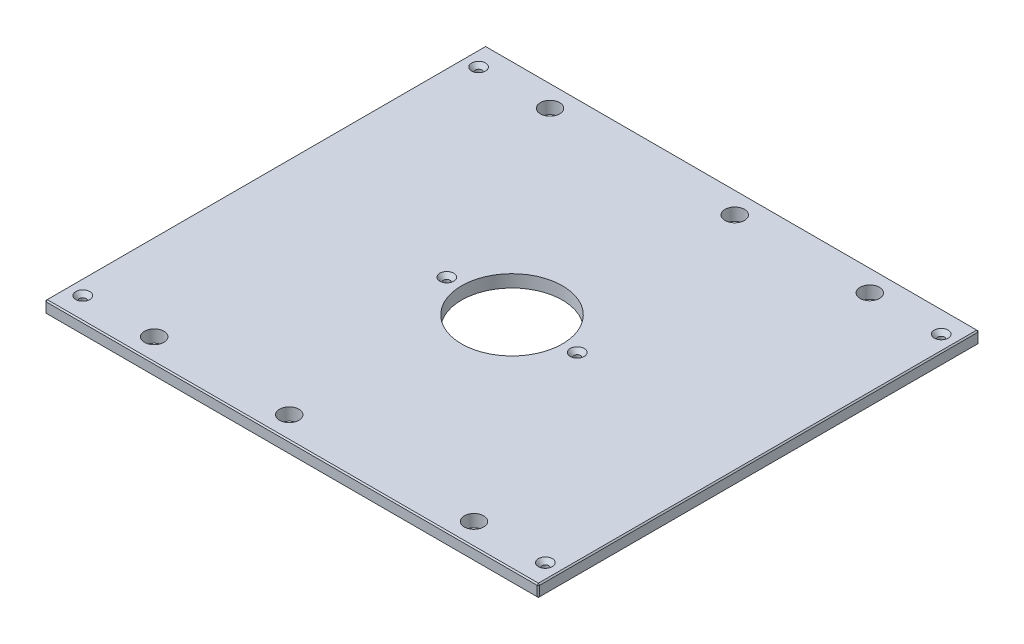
ISO-10303-21;
HEADER;
FILE_DESCRIPTION(('STEP AP214'),'2;1');
FILE_NAME('part.step','',(''),(''),'','','');
FILE_SCHEMA(('AUTOMOTIVE_DESIGN { 1 0 10303 214 1 1 1 1 }'));
ENDSEC;
DATA;
#1=APPLICATION_CONTEXT('core data for automotive mechanical design processes');
#2=APPLICATION_PROTOCOL_DEFINITION('international standard','automotive_design',2000,#1);
#3=PRODUCT_CONTEXT('',#1,'mechanical');
#4=PRODUCT('Part','Part','',(#3));
#5=PRODUCT_RELATED_PRODUCT_CATEGORY('part','',(#4));
#6=PRODUCT_DEFINITION_FORMATION('','',#4);
#7=PRODUCT_DEFINITION_CONTEXT('part definition',#1,'design');
#8=PRODUCT_DEFINITION('design','',#6,#7);
#9=PRODUCT_DEFINITION_SHAPE('','',#8);
#10=(LENGTH_UNIT() NAMED_UNIT(*) SI_UNIT(.MILLI.,.METRE.));
#11=(NAMED_UNIT(*) PLANE_ANGLE_UNIT() SI_UNIT($,.RADIAN.));
#12=(NAMED_UNIT(*) SI_UNIT($,.STERADIAN.) SOLID_ANGLE_UNIT());
#13=UNCERTAINTY_MEASURE_WITH_UNIT(LENGTH_MEASURE(1.E-05),#10,'distance_accuracy_value','');
#14=(GEOMETRIC_REPRESENTATION_CONTEXT(3) GLOBAL_UNCERTAINTY_ASSIGNED_CONTEXT((#13)) GLOBAL_UNIT_ASSIGNED_CONTEXT((#10,
#11,#12)) REPRESENTATION_CONTEXT('',''));
#15=CARTESIAN_POINT('',(0.,0.,0.));
#16=DIRECTION('',(0.,0.,1.));
#17=DIRECTION('',(1.,0.,0.));
#18=AXIS2_PLACEMENT_3D('',#15,#16,#17);
#19=CARTESIAN_POINT('',(-252.4125,12.7,-225.425));
#20=DIRECTION('',(1.,0.,0.));
#21=DIRECTION('',(0.,0.,-1.));
#22=AXIS2_PLACEMENT_3D('',#19,#20,#21);
#23=PLANE('',#22);
#24=DIRECTION('',(0.,0.,-1.));
#25=VECTOR('',#24,1.);
#26=CARTESIAN_POINT('',(-252.4125,11.43,-225.425));
#27=LINE('',#26,#25);
#28=CARTESIAN_POINT('',(-252.4125,11.43,224.155));
#29=VERTEX_POINT('',#28);
#30=CARTESIAN_POINT('',(-252.4125,11.43,-224.155));
#31=VERTEX_POINT('',#30);
#32=EDGE_CURVE('E135',#29,#31,#27,.T.);
#33=ORIENTED_EDGE('',*,*,#32,.T.);
#34=DIRECTION('',(0.,-1.,0.));
#35=VECTOR('',#34,1.);
#36=CARTESIAN_POINT('',(-252.4125,12.7,-224.155));
#37=LINE('',#36,#35);
#38=CARTESIAN_POINT('',(-252.4125,1.26999999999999,-224.155));
#39=VERTEX_POINT('',#38);
#40=EDGE_CURVE('E131',#31,#39,#37,.T.);
#41=ORIENTED_EDGE('',*,*,#40,.T.);
#42=DIRECTION('',(0.,0.,1.));
#43=VECTOR('',#42,1.);
#44=CARTESIAN_POINT('',(-252.4125,1.26999999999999,-225.425));
#45=LINE('',#44,#43);
#46=CARTESIAN_POINT('',(-252.4125,1.26999999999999,224.155));
#47=VERTEX_POINT('',#46);
#48=EDGE_CURVE('E126',#39,#47,#45,.T.);
#49=ORIENTED_EDGE('',*,*,#48,.T.);
#50=DIRECTION('',(0.,1.,0.));
#51=VECTOR('',#50,1.);
#52=CARTESIAN_POINT('',(-252.4125,12.7,224.155));
#53=LINE('',#52,#51);
#54=EDGE_CURVE('E128',#47,#29,#53,.T.);
#55=ORIENTED_EDGE('',*,*,#54,.T.);
#56=EDGE_LOOP('',(#33,#41,#49,#55));
#57=FACE_BOUND('',#56,.T.);
#58=ADVANCED_FACE('F35',(#57),#23,.F.);
#59=CARTESIAN_POINT('',(-252.4125,12.7,225.425));
#60=DIRECTION('',(0.,0.,-1.));
#61=DIRECTION('',(-1.,0.,0.));
#62=AXIS2_PLACEMENT_3D('',#59,#60,#61);
#63=PLANE('',#62);
#64=DIRECTION('',(1.,0.,0.));
#65=VECTOR('',#64,1.);
#66=CARTESIAN_POINT('',(-252.4125,1.26999999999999,225.425));
#67=LINE('',#66,#65);
#68=CARTESIAN_POINT('',(-251.1425,1.26999999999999,225.425));
#69=VERTEX_POINT('',#68);
#70=CARTESIAN_POINT('',(251.1425,1.26999999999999,225.425));
#71=VERTEX_POINT('',#70);
#72=EDGE_CURVE('E58',#69,#71,#67,.T.);
#73=ORIENTED_EDGE('',*,*,#72,.T.);
#74=DIRECTION('',(0.,1.,0.));
#75=VECTOR('',#74,1.);
#76=CARTESIAN_POINT('',(251.1425,12.7,225.425));
#77=LINE('',#76,#75);
#78=CARTESIAN_POINT('',(251.1425,11.43,225.425));
#79=VERTEX_POINT('',#78);
#80=EDGE_CURVE('E11',#71,#79,#77,.T.);
#81=ORIENTED_EDGE('',*,*,#80,.T.);
#82=DIRECTION('',(-1.,0.,0.));
#83=VECTOR('',#82,1.);
#84=CARTESIAN_POINT('',(-252.4125,11.43,225.425));
#85=LINE('',#84,#83);
#86=CARTESIAN_POINT('',(-251.1425,11.43,225.425));
#87=VERTEX_POINT('',#86);
#88=EDGE_CURVE('E44',#79,#87,#85,.T.);
#89=ORIENTED_EDGE('',*,*,#88,.T.);
#90=DIRECTION('',(0.,-1.,0.));
#91=VECTOR('',#90,1.);
#92=CARTESIAN_POINT('',(-251.1425,12.7,225.425));
#93=LINE('',#92,#91);
#94=EDGE_CURVE('E291',#87,#69,#93,.T.);
#95=ORIENTED_EDGE('',*,*,#94,.T.);
#96=EDGE_LOOP('',(#73,#81,#89,#95));
#97=FACE_BOUND('',#96,.T.);
#98=ADVANCED_FACE('F360',(#97),#63,.F.);
#99=CARTESIAN_POINT('',(252.4125,12.7,-225.425));
#100=DIRECTION('',(-1.,0.,0.));
#101=DIRECTION('',(0.,0.,1.));
#102=AXIS2_PLACEMENT_3D('',#99,#100,#101);
#103=PLANE('',#102);
#104=DIRECTION('',(0.,0.,-1.));
#105=VECTOR('',#104,1.);
#106=CARTESIAN_POINT('',(252.4125,1.26999999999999,-225.425));
#107=LINE('',#106,#105);
#108=CARTESIAN_POINT('',(252.4125,1.26999999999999,224.155));
#109=VERTEX_POINT('',#108);
#110=CARTESIAN_POINT('',(252.4125,1.26999999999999,-224.155));
#111=VERTEX_POINT('',#110);
#112=EDGE_CURVE('E286',#109,#111,#107,.T.);
#113=ORIENTED_EDGE('',*,*,#112,.T.);
#114=DIRECTION('',(0.,1.,0.));
#115=VECTOR('',#114,1.);
#116=CARTESIAN_POINT('',(252.4125,12.7,-224.155));
#117=LINE('',#116,#115);
#118=CARTESIAN_POINT('',(252.4125,11.43,-224.155));
#119=VERTEX_POINT('',#118);
#120=EDGE_CURVE('E288',#111,#119,#117,.T.);
#121=ORIENTED_EDGE('',*,*,#120,.T.);
#122=DIRECTION('',(0.,0.,1.));
#123=VECTOR('',#122,1.);
#124=CARTESIAN_POINT('',(252.4125,11.43,225.425));
#125=LINE('',#124,#123);
#126=CARTESIAN_POINT('',(252.4125,11.43,224.155));
#127=VERTEX_POINT('',#126);
#128=EDGE_CURVE('E284',#119,#127,#125,.T.);
#129=ORIENTED_EDGE('',*,*,#128,.T.);
#130=DIRECTION('',(0.,-1.,0.));
#131=VECTOR('',#130,1.);
#132=CARTESIAN_POINT('',(252.4125,12.7,224.155));
#133=LINE('',#132,#131);
#134=EDGE_CURVE('E282',#127,#109,#133,.T.);
#135=ORIENTED_EDGE('',*,*,#134,.T.);
#136=EDGE_LOOP('',(#113,#121,#129,#135));
#137=FACE_BOUND('',#136,.T.);
#138=ADVANCED_FACE('F347',(#137),#103,.F.);
#139=CARTESIAN_POINT('',(-252.4125,12.7,-225.425));
#140=DIRECTION('',(0.,0.,1.));
#141=DIRECTION('',(1.,0.,0.));
#142=AXIS2_PLACEMENT_3D('',#139,#140,#141);
#143=PLANE('',#142);
#144=DIRECTION('',(-1.,0.,0.));
#145=VECTOR('',#144,1.);
#146=CARTESIAN_POINT('',(-252.4125,1.26999999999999,-225.425));
#147=LINE('',#146,#145);
#148=CARTESIAN_POINT('',(251.1425,1.26999999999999,-225.425));
#149=VERTEX_POINT('',#148);
#150=CARTESIAN_POINT('',(-251.1425,1.26999999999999,-225.425));
#151=VERTEX_POINT('',#150);
#152=EDGE_CURVE('E258',#149,#151,#147,.T.);
#153=ORIENTED_EDGE('',*,*,#152,.T.);
#154=DIRECTION('',(0.,1.,0.));
#155=VECTOR('',#154,1.);
#156=CARTESIAN_POINT('',(-251.1425,12.7,-225.425));
#157=LINE('',#156,#155);
#158=CARTESIAN_POINT('',(-251.1425,11.43,-225.425));
#159=VERTEX_POINT('',#158);
#160=EDGE_CURVE('E262',#151,#159,#157,.T.);
#161=ORIENTED_EDGE('',*,*,#160,.T.);
#162=DIRECTION('',(1.,0.,0.));
#163=VECTOR('',#162,1.);
#164=CARTESIAN_POINT('',(252.4125,11.43,-225.425));
#165=LINE('',#164,#163);
#166=CARTESIAN_POINT('',(251.1425,11.43,-225.425));
#167=VERTEX_POINT('',#166);
#168=EDGE_CURVE('E260',#159,#167,#165,.T.);
#169=ORIENTED_EDGE('',*,*,#168,.T.);
#170=DIRECTION('',(0.,-1.,0.));
#171=VECTOR('',#170,1.);
#172=CARTESIAN_POINT('',(251.1425,12.7,-225.425));
#173=LINE('',#172,#171);
#174=EDGE_CURVE('E256',#167,#149,#173,.T.);
#175=ORIENTED_EDGE('',*,*,#174,.T.);
#176=EDGE_LOOP('',(#153,#161,#169,#175));
#177=FACE_BOUND('',#176,.T.);
#178=ADVANCED_FACE('F321',(#177),#143,.F.);
#179=CARTESIAN_POINT('',(0.,12.7,0.));
#180=DIRECTION('',(0.,1.,0.));
#181=DIRECTION('',(0.,0.,1.));
#182=AXIS2_PLACEMENT_3D('',#179,#180,#181);
#183=PLANE('',#182);
#184=CARTESIAN_POINT('',(236.5375,12.7,-202.40498));
#185=DIRECTION('',(0.,1.,0.));
#186=DIRECTION('',(0.,0.,1.));
#187=AXIS2_PLACEMENT_3D('',#184,#185,#186);
#188=CIRCLE('',#187,7.13739999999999);
#189=CARTESIAN_POINT('',(236.5375,12.7,-195.26758));
#190=VERTEX_POINT('',#189);
#191=EDGE_CURVE('E784',#190,#190,#188,.T.);
#192=ORIENTED_EDGE('',*,*,#191,.F.);
#193=EDGE_LOOP('',(#192));
#194=FACE_BOUND('',#193,.T.);
#195=CARTESIAN_POINT('',(236.5375,12.7,202.40498));
#196=DIRECTION('',(0.,1.,0.));
#197=DIRECTION('',(0.,0.,1.));
#198=AXIS2_PLACEMENT_3D('',#195,#196,#197);
#199=CIRCLE('',#198,7.13739999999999);
#200=CARTESIAN_POINT('',(236.5375,12.7,209.54238));
#201=VERTEX_POINT('',#200);
#202=EDGE_CURVE('E788',#201,#201,#199,.T.);
#203=ORIENTED_EDGE('',*,*,#202,.F.);
#204=EDGE_LOOP('',(#203));
#205=FACE_BOUND('',#204,.T.);
#206=CARTESIAN_POINT('',(-236.5375,12.7,202.40498));
#207=DIRECTION('',(0.,1.,0.));
#208=DIRECTION('',(0.,0.,1.));
#209=AXIS2_PLACEMENT_3D('',#206,#207,#208);
#210=CIRCLE('',#209,7.13739999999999);
#211=CARTESIAN_POINT('',(-236.5375,12.7,209.54238));
#212=VERTEX_POINT('',#211);
#213=EDGE_CURVE('E792',#212,#212,#210,.T.);
#214=ORIENTED_EDGE('',*,*,#213,.F.);
#215=EDGE_LOOP('',(#214));
#216=FACE_BOUND('',#215,.T.);
#217=CARTESIAN_POINT('',(-66.675,12.7,0.));
#218=DIRECTION('',(0.,1.,0.));
#219=DIRECTION('',(0.,0.,1.));
#220=AXIS2_PLACEMENT_3D('',#217,#218,#219);
#221=CIRCLE('',#220,7.1374);
#222=CARTESIAN_POINT('',(-66.675,12.7,7.1374));
#223=VERTEX_POINT('',#222);
#224=EDGE_CURVE('E796',#223,#223,#221,.T.);
#225=ORIENTED_EDGE('',*,*,#224,.F.);
#226=EDGE_LOOP('',(#225));
#227=FACE_BOUND('',#226,.T.);
#228=CARTESIAN_POINT('',(66.675,12.7,0.));
#229=DIRECTION('',(0.,1.,0.));
#230=DIRECTION('',(0.,0.,1.));
#231=AXIS2_PLACEMENT_3D('',#228,#229,#230);
#232=CIRCLE('',#231,7.1374);
#233=CARTESIAN_POINT('',(66.675,12.7,7.1374));
#234=VERTEX_POINT('',#233);
#235=EDGE_CURVE('E800',#234,#234,#232,.T.);
#236=ORIENTED_EDGE('',*,*,#235,.F.);
#237=EDGE_LOOP('',(#236));
#238=FACE_BOUND('',#237,.T.);
#239=CARTESIAN_POINT('',(-236.5375,12.7,-202.40498));
#240=DIRECTION('',(0.,1.,0.));
#241=DIRECTION('',(0.,0.,1.));
#242=AXIS2_PLACEMENT_3D('',#239,#240,#241);
#243=CIRCLE('',#242,7.13739999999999);
#244=CARTESIAN_POINT('',(-236.5375,12.7,-195.26758));
#245=VERTEX_POINT('',#244);
#246=EDGE_CURVE('E803',#245,#245,#243,.T.);
#247=ORIENTED_EDGE('',*,*,#246,.F.);
#248=EDGE_LOOP('',(#247));
#249=FACE_BOUND('',#248,.T.);
#250=DIRECTION('',(0.,0.,-1.));
#251=VECTOR('',#250,1.);
#252=CARTESIAN_POINT('',(251.1425,12.7,-225.425));
#253=LINE('',#252,#251);
#254=CARTESIAN_POINT('',(251.1425,12.7,224.155));
#255=VERTEX_POINT('',#254);
#256=CARTESIAN_POINT('',(251.1425,12.7,-224.155));
#257=VERTEX_POINT('',#256);
#258=EDGE_CURVE('E269',#255,#257,#253,.T.);
#259=ORIENTED_EDGE('',*,*,#258,.T.);
#260=DIRECTION('',(-1.,0.,0.));
#261=VECTOR('',#260,1.);
#262=CARTESIAN_POINT('',(-252.4125,12.7,-224.155));
#263=LINE('',#262,#261);
#264=CARTESIAN_POINT('',(-251.1425,12.7,-224.155));
#265=VERTEX_POINT('',#264);
#266=EDGE_CURVE('E271',#257,#265,#263,.T.);
#267=ORIENTED_EDGE('',*,*,#266,.T.);
#268=DIRECTION('',(0.,0.,1.));
#269=VECTOR('',#268,1.);
#270=CARTESIAN_POINT('',(-251.1425,12.7,225.425));
#271=LINE('',#270,#269);
#272=CARTESIAN_POINT('',(-251.1425,12.7,224.155));
#273=VERTEX_POINT('',#272);
#274=EDGE_CURVE('E267',#265,#273,#271,.T.);
#275=ORIENTED_EDGE('',*,*,#274,.T.);
#276=DIRECTION('',(1.,0.,0.));
#277=VECTOR('',#276,1.);
#278=CARTESIAN_POINT('',(252.4125,12.7,224.155));
#279=LINE('',#278,#277);
#280=EDGE_CURVE('E265',#273,#255,#279,.T.);
#281=ORIENTED_EDGE('',*,*,#280,.T.);
#282=EDGE_LOOP('',(#259,#267,#275,#281));
#283=FACE_BOUND('',#282,.T.);
#284=CARTESIAN_POINT('',(163.5125,12.7,-202.40498));
#285=DIRECTION('',(0.,1.,0.));
#286=DIRECTION('',(0.,0.,1.));
#287=AXIS2_PLACEMENT_3D('',#284,#285,#286);
#288=CIRCLE('',#287,9.921875);
#289=CARTESIAN_POINT('',(163.5125,12.7,-192.483105));
#290=VERTEX_POINT('',#289);
#291=EDGE_CURVE('E204',#290,#290,#288,.T.);
#292=ORIENTED_EDGE('',*,*,#291,.F.);
#293=EDGE_LOOP('',(#292));
#294=FACE_BOUND('',#293,.T.);
#295=CARTESIAN_POINT('',(-163.5125,12.7,-202.40498));
#296=DIRECTION('',(0.,1.,0.));
#297=DIRECTION('',(0.,0.,1.));
#298=AXIS2_PLACEMENT_3D('',#295,#296,#297);
#299=CIRCLE('',#298,9.921875);
#300=CARTESIAN_POINT('',(-163.5125,12.7,-192.483105));
#301=VERTEX_POINT('',#300);
#302=EDGE_CURVE('E214',#301,#301,#299,.T.);
#303=ORIENTED_EDGE('',*,*,#302,.F.);
#304=EDGE_LOOP('',(#303));
#305=FACE_BOUND('',#304,.T.);
#306=CARTESIAN_POINT('',(163.5125,12.7,202.40498));
#307=DIRECTION('',(0.,1.,0.));
#308=DIRECTION('',(0.,0.,1.));
#309=AXIS2_PLACEMENT_3D('',#306,#307,#308);
#310=CIRCLE('',#309,9.921875);
#311=CARTESIAN_POINT('',(163.5125,12.7,212.326855));
#312=VERTEX_POINT('',#311);
#313=EDGE_CURVE('E225',#312,#312,#310,.T.);
#314=ORIENTED_EDGE('',*,*,#313,.F.);
#315=EDGE_LOOP('',(#314));
#316=FACE_BOUND('',#315,.T.);
#317=CARTESIAN_POINT('',(-163.5125,12.7,202.40498));
#318=DIRECTION('',(0.,1.,0.));
#319=DIRECTION('',(0.,0.,1.));
#320=AXIS2_PLACEMENT_3D('',#317,#318,#319);
#321=CIRCLE('',#320,9.921875);
#322=CARTESIAN_POINT('',(-163.5125,12.7,212.326855));
#323=VERTEX_POINT('',#322);
#324=EDGE_CURVE('E231',#323,#323,#321,.T.);
#325=ORIENTED_EDGE('',*,*,#324,.F.);
#326=EDGE_LOOP('',(#325));
#327=FACE_BOUND('',#326,.T.);
#328=CARTESIAN_POINT('',(25.4,12.7,-202.40498));
#329=DIRECTION('',(0.,1.,0.));
#330=DIRECTION('',(0.,0.,1.));
#331=AXIS2_PLACEMENT_3D('',#328,#329,#330);
#332=CIRCLE('',#331,9.921875);
#333=CARTESIAN_POINT('',(25.4,12.7,-192.483105));
#334=VERTEX_POINT('',#333);
#335=EDGE_CURVE('E237',#334,#334,#332,.T.);
#336=ORIENTED_EDGE('',*,*,#335,.F.);
#337=EDGE_LOOP('',(#336));
#338=FACE_BOUND('',#337,.T.);
#339=CARTESIAN_POINT('',(-25.4,12.7,202.40498));
#340=DIRECTION('',(0.,1.,0.));
#341=DIRECTION('',(0.,0.,1.));
#342=AXIS2_PLACEMENT_3D('',#339,#340,#341);
#343=CIRCLE('',#342,9.921875);
#344=CARTESIAN_POINT('',(-25.4,12.7,212.326855));
#345=VERTEX_POINT('',#344);
#346=EDGE_CURVE('E243',#345,#345,#343,.T.);
#347=ORIENTED_EDGE('',*,*,#346,.F.);
#348=EDGE_LOOP('',(#347));
#349=FACE_BOUND('',#348,.T.);
#350=CARTESIAN_POINT('',(0.,12.7,0.));
#351=DIRECTION('',(0.,1.,0.));
#352=DIRECTION('',(0.,0.,1.));
#353=AXIS2_PLACEMENT_3D('',#350,#351,#352);
#354=CIRCLE('',#353,51.562);
#355=CARTESIAN_POINT('',(0.,12.7,51.562));
#356=VERTEX_POINT('',#355);
#357=EDGE_CURVE('E249',#356,#356,#354,.T.);
#358=ORIENTED_EDGE('',*,*,#357,.F.);
#359=EDGE_LOOP('',(#358));
#360=FACE_BOUND('',#359,.T.);
#361=ADVANCED_FACE('F369',(#194,#205,#216,#227,#238,#249,#283,#294,#305,#316,#327,#338,#349,
#360),#183,.T.);
#362=CARTESIAN_POINT('',(0.,0.,0.));
#363=DIRECTION('',(0.,1.,0.));
#364=DIRECTION('',(0.,0.,1.));
#365=AXIS2_PLACEMENT_3D('',#362,#363,#364);
#366=PLANE('',#365);
#367=CARTESIAN_POINT('',(236.5375,0.,-202.40498));
#368=DIRECTION('',(0.,1.,0.));
#369=DIRECTION('',(0.,0.,1.));
#370=AXIS2_PLACEMENT_3D('',#367,#368,#369);
#371=CIRCLE('',#370,3.3782);
#372=CARTESIAN_POINT('',(236.5375,0.,-199.02678));
#373=VERTEX_POINT('',#372);
#374=EDGE_CURVE('E837',#373,#373,#371,.T.);
#375=ORIENTED_EDGE('',*,*,#374,.T.);
#376=EDGE_LOOP('',(#375));
#377=FACE_BOUND('',#376,.T.);
#378=CARTESIAN_POINT('',(236.5375,0.,202.40498));
#379=DIRECTION('',(0.,1.,0.));
#380=DIRECTION('',(0.,0.,1.));
#381=AXIS2_PLACEMENT_3D('',#378,#379,#380);
#382=CIRCLE('',#381,3.3782);
#383=CARTESIAN_POINT('',(236.5375,0.,205.78318));
#384=VERTEX_POINT('',#383);
#385=EDGE_CURVE('E830',#384,#384,#382,.T.);
#386=ORIENTED_EDGE('',*,*,#385,.T.);
#387=EDGE_LOOP('',(#386));
#388=FACE_BOUND('',#387,.T.);
#389=CARTESIAN_POINT('',(-236.5375,0.,202.40498));
#390=DIRECTION('',(0.,1.,0.));
#391=DIRECTION('',(0.,0.,1.));
#392=AXIS2_PLACEMENT_3D('',#389,#390,#391);
#393=CIRCLE('',#392,3.3782);
#394=CARTESIAN_POINT('',(-236.5375,0.,205.78318));
#395=VERTEX_POINT('',#394);
#396=EDGE_CURVE('E823',#395,#395,#393,.T.);
#397=ORIENTED_EDGE('',*,*,#396,.T.);
#398=EDGE_LOOP('',(#397));
#399=FACE_BOUND('',#398,.T.);
#400=CARTESIAN_POINT('',(-66.675,0.,0.));
#401=DIRECTION('',(0.,1.,0.));
#402=DIRECTION('',(0.,0.,1.));
#403=AXIS2_PLACEMENT_3D('',#400,#401,#402);
#404=CIRCLE('',#403,3.3782);
#405=CARTESIAN_POINT('',(-66.675,0.,3.3782));
#406=VERTEX_POINT('',#405);
#407=EDGE_CURVE('E816',#406,#406,#404,.T.);
#408=ORIENTED_EDGE('',*,*,#407,.T.);
#409=EDGE_LOOP('',(#408));
#410=FACE_BOUND('',#409,.T.);
#411=CARTESIAN_POINT('',(66.675,0.,0.));
#412=DIRECTION('',(0.,1.,0.));
#413=DIRECTION('',(0.,0.,1.));
#414=AXIS2_PLACEMENT_3D('',#411,#412,#413);
#415=CIRCLE('',#414,3.3782);
#416=CARTESIAN_POINT('',(66.675,0.,3.3782));
#417=VERTEX_POINT('',#416);
#418=EDGE_CURVE('E806',#417,#417,#415,.T.);
#419=ORIENTED_EDGE('',*,*,#418,.T.);
#420=EDGE_LOOP('',(#419));
#421=FACE_BOUND('',#420,.T.);
#422=CARTESIAN_POINT('',(-236.5375,0.,-202.40498));
#423=DIRECTION('',(0.,1.,0.));
#424=DIRECTION('',(0.,0.,1.));
#425=AXIS2_PLACEMENT_3D('',#422,#423,#424);
#426=CIRCLE('',#425,3.3782);
#427=CARTESIAN_POINT('',(-236.5375,0.,-199.02678));
#428=VERTEX_POINT('',#427);
#429=EDGE_CURVE('E217',#428,#428,#426,.T.);
#430=ORIENTED_EDGE('',*,*,#429,.T.);
#431=EDGE_LOOP('',(#430));
#432=FACE_BOUND('',#431,.T.);
#433=DIRECTION('',(0.,0.,-1.));
#434=VECTOR('',#433,1.);
#435=CARTESIAN_POINT('',(-251.1425,0.,0.));
#436=LINE('',#435,#434);
#437=CARTESIAN_POINT('',(-251.1425,0.,224.155));
#438=VERTEX_POINT('',#437);
#439=CARTESIAN_POINT('',(-251.1425,0.,-224.155));
#440=VERTEX_POINT('',#439);
#441=EDGE_CURVE('E158',#438,#440,#436,.T.);
#442=ORIENTED_EDGE('',*,*,#441,.T.);
#443=DIRECTION('',(1.,0.,0.));
#444=VECTOR('',#443,1.);
#445=CARTESIAN_POINT('',(0.,0.,-224.155));
#446=LINE('',#445,#444);
#447=CARTESIAN_POINT('',(251.1425,0.,-224.155));
#448=VERTEX_POINT('',#447);
#449=EDGE_CURVE('E279',#440,#448,#446,.T.);
#450=ORIENTED_EDGE('',*,*,#449,.T.);
#451=DIRECTION('',(0.,0.,1.));
#452=VECTOR('',#451,1.);
#453=CARTESIAN_POINT('',(251.1425,0.,0.));
#454=LINE('',#453,#452);
#455=CARTESIAN_POINT('',(251.1425,0.,224.155));
#456=VERTEX_POINT('',#455);
#457=EDGE_CURVE('E277',#448,#456,#454,.T.);
#458=ORIENTED_EDGE('',*,*,#457,.T.);
#459=DIRECTION('',(-1.,0.,0.));
#460=VECTOR('',#459,1.);
#461=CARTESIAN_POINT('',(0.,0.,224.155));
#462=LINE('',#461,#460);
#463=EDGE_CURVE('E274',#456,#438,#462,.T.);
#464=ORIENTED_EDGE('',*,*,#463,.T.);
#465=EDGE_LOOP('',(#442,#450,#458,#464));
#466=FACE_BOUND('',#465,.T.);
#467=CARTESIAN_POINT('',(163.5125,0.,-202.40498));
#468=DIRECTION('',(0.,1.,0.));
#469=DIRECTION('',(0.,0.,1.));
#470=AXIS2_PLACEMENT_3D('',#467,#468,#469);
#471=CIRCLE('',#470,9.921875);
#472=CARTESIAN_POINT('',(163.5125,0.,-192.483105));
#473=VERTEX_POINT('',#472);
#474=EDGE_CURVE('E209',#473,#473,#471,.T.);
#475=ORIENTED_EDGE('',*,*,#474,.T.);
#476=EDGE_LOOP('',(#475));
#477=FACE_BOUND('',#476,.T.);
#478=CARTESIAN_POINT('',(-163.5125,0.,-202.40498));
#479=DIRECTION('',(0.,1.,0.));
#480=DIRECTION('',(0.,0.,1.));
#481=AXIS2_PLACEMENT_3D('',#478,#479,#480);
#482=CIRCLE('',#481,9.921875);
#483=CARTESIAN_POINT('',(-163.5125,0.,-192.483105));
#484=VERTEX_POINT('',#483);
#485=EDGE_CURVE('E222',#484,#484,#482,.T.);
#486=ORIENTED_EDGE('',*,*,#485,.T.);
#487=EDGE_LOOP('',(#486));
#488=FACE_BOUND('',#487,.T.);
#489=CARTESIAN_POINT('',(163.5125,0.,202.40498));
#490=DIRECTION('',(0.,1.,0.));
#491=DIRECTION('',(0.,0.,1.));
#492=AXIS2_PLACEMENT_3D('',#489,#490,#491);
#493=CIRCLE('',#492,9.921875);
#494=CARTESIAN_POINT('',(163.5125,0.,212.326855));
#495=VERTEX_POINT('',#494);
#496=EDGE_CURVE('E228',#495,#495,#493,.T.);
#497=ORIENTED_EDGE('',*,*,#496,.T.);
#498=EDGE_LOOP('',(#497));
#499=FACE_BOUND('',#498,.T.);
#500=CARTESIAN_POINT('',(-163.5125,0.,202.40498));
#501=DIRECTION('',(0.,1.,0.));
#502=DIRECTION('',(0.,0.,1.));
#503=AXIS2_PLACEMENT_3D('',#500,#501,#502);
#504=CIRCLE('',#503,9.921875);
#505=CARTESIAN_POINT('',(-163.5125,0.,212.326855));
#506=VERTEX_POINT('',#505);
#507=EDGE_CURVE('E234',#506,#506,#504,.T.);
#508=ORIENTED_EDGE('',*,*,#507,.T.);
#509=EDGE_LOOP('',(#508));
#510=FACE_BOUND('',#509,.T.);
#511=CARTESIAN_POINT('',(25.4,0.,-202.40498));
#512=DIRECTION('',(0.,1.,0.));
#513=DIRECTION('',(0.,0.,1.));
#514=AXIS2_PLACEMENT_3D('',#511,#512,#513);
#515=CIRCLE('',#514,9.921875);
#516=CARTESIAN_POINT('',(25.4,0.,-192.483105));
#517=VERTEX_POINT('',#516);
#518=EDGE_CURVE('E240',#517,#517,#515,.T.);
#519=ORIENTED_EDGE('',*,*,#518,.T.);
#520=EDGE_LOOP('',(#519));
#521=FACE_BOUND('',#520,.T.);
#522=CARTESIAN_POINT('',(-25.4,0.,202.40498));
#523=DIRECTION('',(0.,1.,0.));
#524=DIRECTION('',(0.,0.,1.));
#525=AXIS2_PLACEMENT_3D('',#522,#523,#524);
#526=CIRCLE('',#525,9.921875);
#527=CARTESIAN_POINT('',(-25.4,0.,212.326855));
#528=VERTEX_POINT('',#527);
#529=EDGE_CURVE('E246',#528,#528,#526,.T.);
#530=ORIENTED_EDGE('',*,*,#529,.T.);
#531=EDGE_LOOP('',(#530));
#532=FACE_BOUND('',#531,.T.);
#533=CARTESIAN_POINT('',(0.,0.,0.));
#534=DIRECTION('',(0.,1.,0.));
#535=DIRECTION('',(0.,0.,1.));
#536=AXIS2_PLACEMENT_3D('',#533,#534,#535);
#537=CIRCLE('',#536,51.562);
#538=CARTESIAN_POINT('',(0.,0.,51.562));
#539=VERTEX_POINT('',#538);
#540=EDGE_CURVE('E147',#539,#539,#537,.T.);
#541=ORIENTED_EDGE('',*,*,#540,.T.);
#542=EDGE_LOOP('',(#541));
#543=FACE_BOUND('',#542,.T.);
#544=ADVANCED_FACE('F334',(#377,#388,#399,#410,#421,#432,#466,#477,#488,#499,#510,#521,#532,
#543),#366,.F.);
#545=CARTESIAN_POINT('',(0.,0.,0.));
#546=DIRECTION('',(0.,1.,0.));
#547=DIRECTION('',(0.,0.,1.));
#548=AXIS2_PLACEMENT_3D('',#545,#546,#547);
#549=CYLINDRICAL_SURFACE('',#548,51.562);
#550=ORIENTED_EDGE('',*,*,#540,.F.);
#551=EDGE_LOOP('',(#550));
#552=FACE_BOUND('',#551,.T.);
#553=ORIENTED_EDGE('',*,*,#357,.T.);
#554=EDGE_LOOP('',(#553));
#555=FACE_BOUND('',#554,.T.);
#556=ADVANCED_FACE('F721',(#552,#555),#549,.F.);
#557=CARTESIAN_POINT('',(-25.4,12.7,202.40498));
#558=DIRECTION('',(0.,1.,0.));
#559=DIRECTION('',(0.,0.,1.));
#560=AXIS2_PLACEMENT_3D('',#557,#558,#559);
#561=CYLINDRICAL_SURFACE('',#560,9.921875);
#562=ORIENTED_EDGE('',*,*,#529,.F.);
#563=EDGE_LOOP('',(#562));
#564=FACE_BOUND('',#563,.T.);
#565=ORIENTED_EDGE('',*,*,#346,.T.);
#566=EDGE_LOOP('',(#565));
#567=FACE_BOUND('',#566,.T.);
#568=ADVANCED_FACE('F712',(#564,#567),#561,.F.);
#569=CARTESIAN_POINT('',(25.4,12.7,-202.40498));
#570=DIRECTION('',(0.,1.,0.));
#571=DIRECTION('',(0.,0.,1.));
#572=AXIS2_PLACEMENT_3D('',#569,#570,#571);
#573=CYLINDRICAL_SURFACE('',#572,9.921875);
#574=ORIENTED_EDGE('',*,*,#518,.F.);
#575=EDGE_LOOP('',(#574));
#576=FACE_BOUND('',#575,.T.);
#577=ORIENTED_EDGE('',*,*,#335,.T.);
#578=EDGE_LOOP('',(#577));
#579=FACE_BOUND('',#578,.T.);
#580=ADVANCED_FACE('F703',(#576,#579),#573,.F.);
#581=CARTESIAN_POINT('',(-163.5125,12.7,202.40498));
#582=DIRECTION('',(0.,1.,0.));
#583=DIRECTION('',(0.,0.,1.));
#584=AXIS2_PLACEMENT_3D('',#581,#582,#583);
#585=CYLINDRICAL_SURFACE('',#584,9.921875);
#586=ORIENTED_EDGE('',*,*,#507,.F.);
#587=EDGE_LOOP('',(#586));
#588=FACE_BOUND('',#587,.T.);
#589=ORIENTED_EDGE('',*,*,#324,.T.);
#590=EDGE_LOOP('',(#589));
#591=FACE_BOUND('',#590,.T.);
#592=ADVANCED_FACE('F694',(#588,#591),#585,.F.);
#593=CARTESIAN_POINT('',(163.5125,12.7,202.40498));
#594=DIRECTION('',(0.,1.,0.));
#595=DIRECTION('',(0.,0.,1.));
#596=AXIS2_PLACEMENT_3D('',#593,#594,#595);
#597=CYLINDRICAL_SURFACE('',#596,9.921875);
#598=ORIENTED_EDGE('',*,*,#496,.F.);
#599=EDGE_LOOP('',(#598));
#600=FACE_BOUND('',#599,.T.);
#601=ORIENTED_EDGE('',*,*,#313,.T.);
#602=EDGE_LOOP('',(#601));
#603=FACE_BOUND('',#602,.T.);
#604=ADVANCED_FACE('F685',(#600,#603),#597,.F.);
#605=CARTESIAN_POINT('',(-163.5125,12.7,-202.40498));
#606=DIRECTION('',(0.,1.,0.));
#607=DIRECTION('',(0.,0.,1.));
#608=AXIS2_PLACEMENT_3D('',#605,#606,#607);
#609=CYLINDRICAL_SURFACE('',#608,9.921875);
#610=ORIENTED_EDGE('',*,*,#485,.F.);
#611=EDGE_LOOP('',(#610));
#612=FACE_BOUND('',#611,.T.);
#613=ORIENTED_EDGE('',*,*,#302,.T.);
#614=EDGE_LOOP('',(#613));
#615=FACE_BOUND('',#614,.T.);
#616=ADVANCED_FACE('F675',(#612,#615),#609,.F.);
#617=CARTESIAN_POINT('',(163.5125,12.7,-202.40498));
#618=DIRECTION('',(0.,1.,0.));
#619=DIRECTION('',(0.,0.,1.));
#620=AXIS2_PLACEMENT_3D('',#617,#618,#619);
#621=CYLINDRICAL_SURFACE('',#620,9.921875);
#622=ORIENTED_EDGE('',*,*,#474,.F.);
#623=EDGE_LOOP('',(#622));
#624=FACE_BOUND('',#623,.T.);
#625=ORIENTED_EDGE('',*,*,#291,.T.);
#626=EDGE_LOOP('',(#625));
#627=FACE_BOUND('',#626,.T.);
#628=ADVANCED_FACE('F378',(#624,#627),#621,.F.);
#629=CARTESIAN_POINT('',(252.4125,12.7,224.155));
#630=DIRECTION('',(-0.707106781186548,0.,-0.707106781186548));
#631=DIRECTION('',(0.,-1.,0.));
#632=AXIS2_PLACEMENT_3D('',#629,#630,#631);
#633=PLANE('',#632);
#634=DIRECTION('',(-0.707106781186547,0.,0.707106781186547));
#635=VECTOR('',#634,1.);
#636=CARTESIAN_POINT('',(252.4125,11.43,224.155));
#637=LINE('',#636,#635);
#638=EDGE_CURVE('E39',#79,#127,#637,.F.);
#639=ORIENTED_EDGE('',*,*,#638,.F.);
#640=ORIENTED_EDGE('',*,*,#80,.F.);
#641=DIRECTION('',(0.707106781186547,0.,-0.707106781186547));
#642=VECTOR('',#641,1.);
#643=CARTESIAN_POINT('',(251.7775,1.26999999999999,224.79));
#644=LINE('',#643,#642);
#645=EDGE_CURVE('E197',#109,#71,#644,.F.);
#646=ORIENTED_EDGE('',*,*,#645,.F.);
#647=ORIENTED_EDGE('',*,*,#134,.F.);
#648=EDGE_LOOP('',(#639,#640,#646,#647));
#649=FACE_BOUND('',#648,.T.);
#650=ADVANCED_FACE('F37',(#649),#633,.F.);
#651=CARTESIAN_POINT('',(252.4125,11.43,224.155));
#652=DIRECTION('',(0.577350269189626,0.577350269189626,0.577350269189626));
#653=DIRECTION('',(0.707106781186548,0.,-0.707106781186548));
#654=AXIS2_PLACEMENT_3D('',#651,#652,#653);
#655=PLANE('',#654);
#656=DIRECTION('',(0.,-0.707106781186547,0.707106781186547));
#657=VECTOR('',#656,1.);
#658=CARTESIAN_POINT('',(251.1425,12.065,224.79));
#659=LINE('',#658,#657);
#660=EDGE_CURVE('E193',#79,#255,#659,.F.);
#661=ORIENTED_EDGE('',*,*,#660,.F.);
#662=ORIENTED_EDGE('',*,*,#638,.T.);
#663=DIRECTION('',(-0.707106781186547,0.707106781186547,0.));
#664=VECTOR('',#663,1.);
#665=CARTESIAN_POINT('',(252.4125,11.43,224.155));
#666=LINE('',#665,#664);
#667=EDGE_CURVE('E195',#255,#127,#666,.F.);
#668=ORIENTED_EDGE('',*,*,#667,.F.);
#669=EDGE_LOOP('',(#661,#662,#668));
#670=FACE_BOUND('',#669,.T.);
#671=ADVANCED_FACE('F371',(#670),#655,.T.);
#672=CARTESIAN_POINT('',(251.1425,0.,224.155));
#673=DIRECTION('',(0.577350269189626,-0.577350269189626,0.577350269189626));
#674=DIRECTION('',(0.707106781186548,0.,-0.707106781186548));
#675=AXIS2_PLACEMENT_3D('',#672,#673,#674);
#676=PLANE('',#675);
#677=DIRECTION('',(-0.707106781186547,-0.707106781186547,0.));
#678=VECTOR('',#677,1.);
#679=CARTESIAN_POINT('',(251.1425,0.,224.155));
#680=LINE('',#679,#678);
#681=EDGE_CURVE('E187',#109,#456,#680,.T.);
#682=ORIENTED_EDGE('',*,*,#681,.F.);
#683=ORIENTED_EDGE('',*,*,#645,.T.);
#684=DIRECTION('',(0.,0.707106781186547,0.707106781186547));
#685=VECTOR('',#684,1.);
#686=CARTESIAN_POINT('',(251.1425,0.,224.155));
#687=LINE('',#686,#685);
#688=EDGE_CURVE('E190',#456,#71,#687,.T.);
#689=ORIENTED_EDGE('',*,*,#688,.F.);
#690=EDGE_LOOP('',(#682,#683,#689));
#691=FACE_BOUND('',#690,.T.);
#692=ADVANCED_FACE('F340',(#691),#676,.T.);
#693=CARTESIAN_POINT('',(251.1425,12.7,0.));
#694=DIRECTION('',(0.707106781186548,0.707106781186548,0.));
#695=DIRECTION('',(0.,0.,1.));
#696=AXIS2_PLACEMENT_3D('',#693,#694,#695);
#697=PLANE('',#696);
#698=ORIENTED_EDGE('',*,*,#667,.T.);
#699=ORIENTED_EDGE('',*,*,#128,.F.);
#700=DIRECTION('',(0.707106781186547,-0.707106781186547,0.));
#701=VECTOR('',#700,1.);
#702=CARTESIAN_POINT('',(251.7775,12.065,-224.155));
#703=LINE('',#702,#701);
#704=EDGE_CURVE('E182',#257,#119,#703,.T.);
#705=ORIENTED_EDGE('',*,*,#704,.F.);
#706=ORIENTED_EDGE('',*,*,#258,.F.);
#707=EDGE_LOOP('',(#698,#699,#705,#706));
#708=FACE_BOUND('',#707,.T.);
#709=ADVANCED_FACE('F357',(#708),#697,.T.);
#710=CARTESIAN_POINT('',(0.,12.7,224.155));
#711=DIRECTION('',(0.,0.707106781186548,0.707106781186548));
#712=DIRECTION('',(-1.,0.,0.));
#713=AXIS2_PLACEMENT_3D('',#710,#711,#712);
#714=PLANE('',#713);
#715=ORIENTED_EDGE('',*,*,#660,.T.);
#716=ORIENTED_EDGE('',*,*,#280,.F.);
#717=DIRECTION('',(0.,0.707106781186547,-0.707106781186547));
#718=VECTOR('',#717,1.);
#719=CARTESIAN_POINT('',(-251.1425,12.7,224.155));
#720=LINE('',#719,#718);
#721=EDGE_CURVE('E179',#87,#273,#720,.T.);
#722=ORIENTED_EDGE('',*,*,#721,.F.);
#723=ORIENTED_EDGE('',*,*,#88,.F.);
#724=EDGE_LOOP('',(#715,#716,#722,#723));
#725=FACE_BOUND('',#724,.T.);
#726=ADVANCED_FACE('F362',(#725),#714,.T.);
#727=CARTESIAN_POINT('',(-251.1425,12.7,225.425));
#728=DIRECTION('',(0.707106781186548,0.,-0.707106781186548));
#729=DIRECTION('',(0.,-1.,0.));
#730=AXIS2_PLACEMENT_3D('',#727,#728,#729);
#731=PLANE('',#730);
#732=DIRECTION('',(0.707106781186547,0.,0.707106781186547));
#733=VECTOR('',#732,1.);
#734=CARTESIAN_POINT('',(-252.4125,1.26999999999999,224.155));
#735=LINE('',#734,#733);
#736=EDGE_CURVE('E142',#69,#47,#735,.F.);
#737=ORIENTED_EDGE('',*,*,#736,.F.);
#738=ORIENTED_EDGE('',*,*,#94,.F.);
#739=DIRECTION('',(-0.707106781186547,0.,-0.707106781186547));
#740=VECTOR('',#739,1.);
#741=CARTESIAN_POINT('',(-251.7775,11.43,224.79));
#742=LINE('',#741,#740);
#743=EDGE_CURVE('E145',#29,#87,#742,.F.);
#744=ORIENTED_EDGE('',*,*,#743,.F.);
#745=ORIENTED_EDGE('',*,*,#54,.F.);
#746=EDGE_LOOP('',(#737,#738,#744,#745));
#747=FACE_BOUND('',#746,.T.);
#748=ADVANCED_FACE('F140',(#747),#731,.F.);
#749=CARTESIAN_POINT('',(-252.4125,1.26999999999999,225.425));
#750=DIRECTION('',(0.,0.707106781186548,-0.707106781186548));
#751=DIRECTION('',(1.,0.,0.));
#752=AXIS2_PLACEMENT_3D('',#749,#750,#751);
#753=PLANE('',#752);
#754=ORIENTED_EDGE('',*,*,#688,.T.);
#755=ORIENTED_EDGE('',*,*,#72,.F.);
#756=DIRECTION('',(0.,-0.707106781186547,-0.707106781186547));
#757=VECTOR('',#756,1.);
#758=CARTESIAN_POINT('',(-251.1425,0.634999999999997,224.79));
#759=LINE('',#758,#757);
#760=EDGE_CURVE('E155',#438,#69,#759,.F.);
#761=ORIENTED_EDGE('',*,*,#760,.F.);
#762=ORIENTED_EDGE('',*,*,#463,.F.);
#763=EDGE_LOOP('',(#754,#755,#761,#762));
#764=FACE_BOUND('',#763,.T.);
#765=ADVANCED_FACE('F339',(#764),#753,.F.);
#766=CARTESIAN_POINT('',(252.4125,1.26999999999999,-225.425));
#767=DIRECTION('',(-0.707106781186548,0.707106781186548,0.));
#768=DIRECTION('',(0.,0.,-1.));
#769=AXIS2_PLACEMENT_3D('',#766,#767,#768);
#770=PLANE('',#769);
#771=ORIENTED_EDGE('',*,*,#681,.T.);
#772=ORIENTED_EDGE('',*,*,#457,.F.);
#773=DIRECTION('',(0.707106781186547,0.707106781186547,0.));
#774=VECTOR('',#773,1.);
#775=CARTESIAN_POINT('',(251.1425,0.,-224.155));
#776=LINE('',#775,#774);
#777=EDGE_CURVE('E174',#111,#448,#776,.F.);
#778=ORIENTED_EDGE('',*,*,#777,.F.);
#779=ORIENTED_EDGE('',*,*,#112,.F.);
#780=EDGE_LOOP('',(#771,#772,#778,#779));
#781=FACE_BOUND('',#780,.T.);
#782=ADVANCED_FACE('F344',(#781),#770,.F.);
#783=CARTESIAN_POINT('',(251.1425,12.7,-225.425));
#784=DIRECTION('',(-0.707106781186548,0.,0.707106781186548));
#785=DIRECTION('',(0.,-1.,0.));
#786=AXIS2_PLACEMENT_3D('',#783,#784,#785);
#787=PLANE('',#786);
#788=DIRECTION('',(0.707106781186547,0.,0.707106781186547));
#789=VECTOR('',#788,1.);
#790=CARTESIAN_POINT('',(251.1425,11.43,-225.425));
#791=LINE('',#790,#789);
#792=EDGE_CURVE('E184',#119,#167,#791,.F.);
#793=ORIENTED_EDGE('',*,*,#792,.F.);
#794=ORIENTED_EDGE('',*,*,#120,.F.);
#795=DIRECTION('',(-0.707106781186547,0.,-0.707106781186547));
#796=VECTOR('',#795,1.);
#797=CARTESIAN_POINT('',(251.7775,1.26999999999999,-224.79));
#798=LINE('',#797,#796);
#799=EDGE_CURVE('E171',#149,#111,#798,.F.);
#800=ORIENTED_EDGE('',*,*,#799,.F.);
#801=ORIENTED_EDGE('',*,*,#174,.F.);
#802=EDGE_LOOP('',(#793,#794,#800,#801));
#803=FACE_BOUND('',#802,.T.);
#804=ADVANCED_FACE('F352',(#803),#787,.F.);
#805=CARTESIAN_POINT('',(251.1425,11.43,-225.425));
#806=DIRECTION('',(0.577350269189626,0.577350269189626,-0.577350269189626));
#807=DIRECTION('',(-0.707106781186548,0.,-0.707106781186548));
#808=AXIS2_PLACEMENT_3D('',#805,#806,#807);
#809=PLANE('',#808);
#810=ORIENTED_EDGE('',*,*,#704,.T.);
#811=ORIENTED_EDGE('',*,*,#792,.T.);
#812=DIRECTION('',(0.,0.707106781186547,0.707106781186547));
#813=VECTOR('',#812,1.);
#814=CARTESIAN_POINT('',(251.1425,11.43,-225.425));
#815=LINE('',#814,#813);
#816=EDGE_CURVE('E163',#257,#167,#815,.F.);
#817=ORIENTED_EDGE('',*,*,#816,.F.);
#818=EDGE_LOOP('',(#810,#811,#817));
#819=FACE_BOUND('',#818,.T.);
#820=ADVANCED_FACE('F410',(#819),#809,.T.);
#821=CARTESIAN_POINT('',(-251.1425,12.7,224.155));
#822=DIRECTION('',(-0.577350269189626,0.577350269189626,0.577350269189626));
#823=DIRECTION('',(0.707106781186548,0.,0.707106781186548));
#824=AXIS2_PLACEMENT_3D('',#821,#822,#823);
#825=PLANE('',#824);
#826=ORIENTED_EDGE('',*,*,#743,.T.);
#827=ORIENTED_EDGE('',*,*,#721,.T.);
#828=DIRECTION('',(-0.707106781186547,-0.707106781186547,0.));
#829=VECTOR('',#828,1.);
#830=CARTESIAN_POINT('',(-251.1425,12.7,224.155));
#831=LINE('',#830,#829);
#832=EDGE_CURVE('E159',#29,#273,#831,.F.);
#833=ORIENTED_EDGE('',*,*,#832,.F.);
#834=EDGE_LOOP('',(#826,#827,#833));
#835=FACE_BOUND('',#834,.T.);
#836=ADVANCED_FACE('F364',(#835),#825,.T.);
#837=CARTESIAN_POINT('',(-252.4125,1.26999999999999,224.155));
#838=DIRECTION('',(-0.577350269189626,-0.577350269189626,0.577350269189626));
#839=DIRECTION('',(0.707106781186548,0.,0.707106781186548));
#840=AXIS2_PLACEMENT_3D('',#837,#838,#839);
#841=PLANE('',#840);
#842=ORIENTED_EDGE('',*,*,#760,.T.);
#843=ORIENTED_EDGE('',*,*,#736,.T.);
#844=DIRECTION('',(-0.707106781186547,0.707106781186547,0.));
#845=VECTOR('',#844,1.);
#846=CARTESIAN_POINT('',(-252.4125,1.26999999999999,224.155));
#847=LINE('',#846,#845);
#848=EDGE_CURVE('E152',#438,#47,#847,.T.);
#849=ORIENTED_EDGE('',*,*,#848,.F.);
#850=EDGE_LOOP('',(#842,#843,#849));
#851=FACE_BOUND('',#850,.T.);
#852=ADVANCED_FACE('F151',(#851),#841,.T.);
#853=CARTESIAN_POINT('',(251.1425,0.,-224.155));
#854=DIRECTION('',(0.577350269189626,-0.577350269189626,-0.577350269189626));
#855=DIRECTION('',(-0.707106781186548,0.,-0.707106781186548));
#856=AXIS2_PLACEMENT_3D('',#853,#854,#855);
#857=PLANE('',#856);
#858=ORIENTED_EDGE('',*,*,#799,.T.);
#859=ORIENTED_EDGE('',*,*,#777,.T.);
#860=DIRECTION('',(0.,-0.707106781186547,0.707106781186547));
#861=VECTOR('',#860,1.);
#862=CARTESIAN_POINT('',(251.1425,0.,-224.155));
#863=LINE('',#862,#861);
#864=EDGE_CURVE('E160',#149,#448,#863,.T.);
#865=ORIENTED_EDGE('',*,*,#864,.F.);
#866=EDGE_LOOP('',(#858,#859,#865));
#867=FACE_BOUND('',#866,.T.);
#868=ADVANCED_FACE('F402',(#867),#857,.T.);
#869=CARTESIAN_POINT('',(0.,12.7,-224.155));
#870=DIRECTION('',(0.,0.707106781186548,-0.707106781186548));
#871=DIRECTION('',(1.,0.,0.));
#872=AXIS2_PLACEMENT_3D('',#869,#870,#871);
#873=PLANE('',#872);
#874=ORIENTED_EDGE('',*,*,#816,.T.);
#875=ORIENTED_EDGE('',*,*,#168,.F.);
#876=DIRECTION('',(0.,-0.707106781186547,-0.707106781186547));
#877=VECTOR('',#876,1.);
#878=CARTESIAN_POINT('',(-251.1425,11.43,-225.425));
#879=LINE('',#878,#877);
#880=EDGE_CURVE('E165',#265,#159,#879,.T.);
#881=ORIENTED_EDGE('',*,*,#880,.F.);
#882=ORIENTED_EDGE('',*,*,#266,.F.);
#883=EDGE_LOOP('',(#874,#875,#881,#882));
#884=FACE_BOUND('',#883,.T.);
#885=ADVANCED_FACE('F316',(#884),#873,.T.);
#886=CARTESIAN_POINT('',(-251.1425,12.7,0.));
#887=DIRECTION('',(-0.707106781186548,0.707106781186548,0.));
#888=DIRECTION('',(0.,0.,-1.));
#889=AXIS2_PLACEMENT_3D('',#886,#887,#888);
#890=PLANE('',#889);
#891=ORIENTED_EDGE('',*,*,#832,.T.);
#892=ORIENTED_EDGE('',*,*,#274,.F.);
#893=DIRECTION('',(0.707106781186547,0.707106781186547,0.));
#894=VECTOR('',#893,1.);
#895=CARTESIAN_POINT('',(-251.7775,12.065,-224.155));
#896=LINE('',#895,#894);
#897=EDGE_CURVE('E305',#31,#265,#896,.T.);
#898=ORIENTED_EDGE('',*,*,#897,.F.);
#899=ORIENTED_EDGE('',*,*,#32,.F.);
#900=EDGE_LOOP('',(#891,#892,#898,#899));
#901=FACE_BOUND('',#900,.T.);
#902=ADVANCED_FACE('F367',(#901),#890,.T.);
#903=CARTESIAN_POINT('',(-252.4125,1.26999999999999,-225.425));
#904=DIRECTION('',(0.707106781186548,0.707106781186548,0.));
#905=DIRECTION('',(0.,0.,1.));
#906=AXIS2_PLACEMENT_3D('',#903,#904,#905);
#907=PLANE('',#906);
#908=ORIENTED_EDGE('',*,*,#848,.T.);
#909=ORIENTED_EDGE('',*,*,#48,.F.);
#910=DIRECTION('',(0.707106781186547,-0.707106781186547,0.));
#911=VECTOR('',#910,1.);
#912=CARTESIAN_POINT('',(-252.4125,1.26999999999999,-224.155));
#913=LINE('',#912,#911);
#914=EDGE_CURVE('E302',#440,#39,#913,.F.);
#915=ORIENTED_EDGE('',*,*,#914,.F.);
#916=ORIENTED_EDGE('',*,*,#441,.F.);
#917=EDGE_LOOP('',(#908,#909,#915,#916));
#918=FACE_BOUND('',#917,.T.);
#919=ADVANCED_FACE('F157',(#918),#907,.F.);
#920=CARTESIAN_POINT('',(-252.4125,1.26999999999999,-225.425));
#921=DIRECTION('',(0.,0.707106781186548,0.707106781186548));
#922=DIRECTION('',(-1.,0.,0.));
#923=AXIS2_PLACEMENT_3D('',#920,#921,#922);
#924=PLANE('',#923);
#925=ORIENTED_EDGE('',*,*,#864,.T.);
#926=ORIENTED_EDGE('',*,*,#449,.F.);
#927=DIRECTION('',(0.,0.707106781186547,-0.707106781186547));
#928=VECTOR('',#927,1.);
#929=CARTESIAN_POINT('',(-251.1425,0.634999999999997,-224.79));
#930=LINE('',#929,#928);
#931=EDGE_CURVE('E299',#151,#440,#930,.F.);
#932=ORIENTED_EDGE('',*,*,#931,.F.);
#933=ORIENTED_EDGE('',*,*,#152,.F.);
#934=EDGE_LOOP('',(#925,#926,#932,#933));
#935=FACE_BOUND('',#934,.T.);
#936=ADVANCED_FACE('F331',(#935),#924,.F.);
#937=CARTESIAN_POINT('',(-251.1425,11.43,-225.425));
#938=DIRECTION('',(-0.577350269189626,0.577350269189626,-0.577350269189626));
#939=DIRECTION('',(-0.707106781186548,0.,0.707106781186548));
#940=AXIS2_PLACEMENT_3D('',#937,#938,#939);
#941=PLANE('',#940);
#942=ORIENTED_EDGE('',*,*,#897,.T.);
#943=ORIENTED_EDGE('',*,*,#880,.T.);
#944=DIRECTION('',(0.707106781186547,0.,-0.707106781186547));
#945=VECTOR('',#944,1.);
#946=CARTESIAN_POINT('',(-251.1425,11.43,-225.425));
#947=LINE('',#946,#945);
#948=EDGE_CURVE('E297',#31,#159,#947,.T.);
#949=ORIENTED_EDGE('',*,*,#948,.F.);
#950=EDGE_LOOP('',(#942,#943,#949));
#951=FACE_BOUND('',#950,.T.);
#952=ADVANCED_FACE('F311',(#951),#941,.T.);
#953=CARTESIAN_POINT('',(-252.4125,1.26999999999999,-224.155));
#954=DIRECTION('',(-0.577350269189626,-0.577350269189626,-0.577350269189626));
#955=DIRECTION('',(-0.707106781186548,0.,0.707106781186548));
#956=AXIS2_PLACEMENT_3D('',#953,#954,#955);
#957=PLANE('',#956);
#958=ORIENTED_EDGE('',*,*,#931,.T.);
#959=ORIENTED_EDGE('',*,*,#914,.T.);
#960=DIRECTION('',(-0.707106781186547,0.,0.707106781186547));
#961=VECTOR('',#960,1.);
#962=CARTESIAN_POINT('',(-252.4125,1.26999999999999,-224.155));
#963=LINE('',#962,#961);
#964=EDGE_CURVE('E295',#151,#39,#963,.T.);
#965=ORIENTED_EDGE('',*,*,#964,.F.);
#966=EDGE_LOOP('',(#958,#959,#965));
#967=FACE_BOUND('',#966,.T.);
#968=ADVANCED_FACE('F328',(#967),#957,.T.);
#969=CARTESIAN_POINT('',(-252.4125,12.7,-224.155));
#970=DIRECTION('',(0.707106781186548,0.,0.707106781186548));
#971=DIRECTION('',(0.,-1.,0.));
#972=AXIS2_PLACEMENT_3D('',#969,#970,#971);
#973=PLANE('',#972);
#974=ORIENTED_EDGE('',*,*,#948,.T.);
#975=ORIENTED_EDGE('',*,*,#160,.F.);
#976=ORIENTED_EDGE('',*,*,#964,.T.);
#977=ORIENTED_EDGE('',*,*,#40,.F.);
#978=EDGE_LOOP('',(#974,#975,#976,#977));
#979=FACE_BOUND('',#978,.T.);
#980=ADVANCED_FACE('F326',(#979),#973,.F.);
#981=CARTESIAN_POINT('',(-236.5375,12.7,-202.40498));
#982=DIRECTION('',(0.,1.,0.));
#983=DIRECTION('',(0.,0.,1.));
#984=AXIS2_PLACEMENT_3D('',#981,#982,#983);
#985=CYLINDRICAL_SURFACE('',#984,3.3782);
#986=ORIENTED_EDGE('',*,*,#429,.F.);
#987=EDGE_LOOP('',(#986));
#988=FACE_BOUND('',#987,.T.);
#989=CARTESIAN_POINT('',(-236.5375,8.37553508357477,-202.40498));
#990=DIRECTION('',(0.,1.,0.));
#991=DIRECTION('',(0.,0.,1.));
#992=AXIS2_PLACEMENT_3D('',#989,#990,#991);
#993=CIRCLE('',#992,3.3782);
#994=CARTESIAN_POINT('',(-236.5375,8.37553508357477,-199.02678));
#995=VERTEX_POINT('',#994);
#996=EDGE_CURVE('E805',#995,#995,#993,.T.);
#997=ORIENTED_EDGE('',*,*,#996,.T.);
#998=EDGE_LOOP('',(#997));
#999=FACE_BOUND('',#998,.T.);
#1000=ADVANCED_FACE('F389',(#988,#999),#985,.F.);
#1001=CARTESIAN_POINT('',(-236.5375,12.7,-202.40498));
#1002=DIRECTION('',(0.,1.,0.));
#1003=DIRECTION('',(0.,0.,1.));
#1004=AXIS2_PLACEMENT_3D('',#1001,#1002,#1003);
#1005=CONICAL_SURFACE('',#1004,7.13739999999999,0.715584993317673);
#1006=ORIENTED_EDGE('',*,*,#996,.F.);
#1007=EDGE_LOOP('',(#1006));
#1008=FACE_BOUND('',#1007,.T.);
#1009=ORIENTED_EDGE('',*,*,#246,.T.);
#1010=EDGE_LOOP('',(#1009));
#1011=FACE_BOUND('',#1010,.T.);
#1012=ADVANCED_FACE('F499',(#1008,#1011),#1005,.F.);
#1013=CARTESIAN_POINT('',(66.675,12.7,0.));
#1014=DIRECTION('',(0.,1.,0.));
#1015=DIRECTION('',(0.,0.,1.));
#1016=AXIS2_PLACEMENT_3D('',#1013,#1014,#1015);
#1017=CYLINDRICAL_SURFACE('',#1016,3.3782);
#1018=ORIENTED_EDGE('',*,*,#418,.F.);
#1019=EDGE_LOOP('',(#1018));
#1020=FACE_BOUND('',#1019,.T.);
#1021=CARTESIAN_POINT('',(66.675,8.37553508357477,0.));
#1022=DIRECTION('',(0.,1.,0.));
#1023=DIRECTION('',(0.,0.,1.));
#1024=AXIS2_PLACEMENT_3D('',#1021,#1022,#1023);
#1025=CIRCLE('',#1024,3.3782);
#1026=CARTESIAN_POINT('',(66.675,8.37553508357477,3.3782));
#1027=VERTEX_POINT('',#1026);
#1028=EDGE_CURVE('E810',#1027,#1027,#1025,.T.);
#1029=ORIENTED_EDGE('',*,*,#1028,.T.);
#1030=EDGE_LOOP('',(#1029));
#1031=FACE_BOUND('',#1030,.T.);
#1032=ADVANCED_FACE('F508',(#1020,#1031),#1017,.F.);
#1033=CARTESIAN_POINT('',(66.675,12.7,0.));
#1034=DIRECTION('',(0.,1.,0.));
#1035=DIRECTION('',(0.,0.,1.));
#1036=AXIS2_PLACEMENT_3D('',#1033,#1034,#1035);
#1037=CONICAL_SURFACE('',#1036,7.1374,0.715584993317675);
#1038=ORIENTED_EDGE('',*,*,#1028,.F.);
#1039=EDGE_LOOP('',(#1038));
#1040=FACE_BOUND('',#1039,.T.);
#1041=ORIENTED_EDGE('',*,*,#235,.T.);
#1042=EDGE_LOOP('',(#1041));
#1043=FACE_BOUND('',#1042,.T.);
#1044=ADVANCED_FACE('F516',(#1040,#1043),#1037,.F.);
#1045=CARTESIAN_POINT('',(-66.675,12.7,0.));
#1046=DIRECTION('',(0.,1.,0.));
#1047=DIRECTION('',(0.,0.,1.));
#1048=AXIS2_PLACEMENT_3D('',#1045,#1046,#1047);
#1049=CYLINDRICAL_SURFACE('',#1048,3.3782);
#1050=ORIENTED_EDGE('',*,*,#407,.F.);
#1051=EDGE_LOOP('',(#1050));
#1052=FACE_BOUND('',#1051,.T.);
#1053=CARTESIAN_POINT('',(-66.675,8.37553508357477,0.));
#1054=DIRECTION('',(0.,1.,0.));
#1055=DIRECTION('',(0.,0.,1.));
#1056=AXIS2_PLACEMENT_3D('',#1053,#1054,#1055);
#1057=CIRCLE('',#1056,3.3782);
#1058=CARTESIAN_POINT('',(-66.675,8.37553508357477,3.3782));
#1059=VERTEX_POINT('',#1058);
#1060=EDGE_CURVE('E819',#1059,#1059,#1057,.T.);
#1061=ORIENTED_EDGE('',*,*,#1060,.T.);
#1062=EDGE_LOOP('',(#1061));
#1063=FACE_BOUND('',#1062,.T.);
#1064=ADVANCED_FACE('F524',(#1052,#1063),#1049,.F.);
#1065=CARTESIAN_POINT('',(-66.675,12.7,0.));
#1066=DIRECTION('',(0.,1.,0.));
#1067=DIRECTION('',(0.,0.,1.));
#1068=AXIS2_PLACEMENT_3D('',#1065,#1066,#1067);
#1069=CONICAL_SURFACE('',#1068,7.1374,0.715584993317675);
#1070=ORIENTED_EDGE('',*,*,#1060,.F.);
#1071=EDGE_LOOP('',(#1070));
#1072=FACE_BOUND('',#1071,.T.);
#1073=ORIENTED_EDGE('',*,*,#224,.T.);
#1074=EDGE_LOOP('',(#1073));
#1075=FACE_BOUND('',#1074,.T.);
#1076=ADVANCED_FACE('F532',(#1072,#1075),#1069,.F.);
#1077=CARTESIAN_POINT('',(-236.5375,12.7,202.40498));
#1078=DIRECTION('',(0.,1.,0.));
#1079=DIRECTION('',(0.,0.,1.));
#1080=AXIS2_PLACEMENT_3D('',#1077,#1078,#1079);
#1081=CYLINDRICAL_SURFACE('',#1080,3.3782);
#1082=ORIENTED_EDGE('',*,*,#396,.F.);
#1083=EDGE_LOOP('',(#1082));
#1084=FACE_BOUND('',#1083,.T.);
#1085=CARTESIAN_POINT('',(-236.5375,8.37553508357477,202.40498));
#1086=DIRECTION('',(0.,1.,0.));
#1087=DIRECTION('',(0.,0.,1.));
#1088=AXIS2_PLACEMENT_3D('',#1085,#1086,#1087);
#1089=CIRCLE('',#1088,3.3782);
#1090=CARTESIAN_POINT('',(-236.5375,8.37553508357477,205.78318));
#1091=VERTEX_POINT('',#1090);
#1092=EDGE_CURVE('E826',#1091,#1091,#1089,.T.);
#1093=ORIENTED_EDGE('',*,*,#1092,.T.);
#1094=EDGE_LOOP('',(#1093));
#1095=FACE_BOUND('',#1094,.T.);
#1096=ADVANCED_FACE('F540',(#1084,#1095),#1081,.F.);
#1097=CARTESIAN_POINT('',(-236.5375,12.7,202.40498));
#1098=DIRECTION('',(0.,1.,0.));
#1099=DIRECTION('',(0.,0.,1.));
#1100=AXIS2_PLACEMENT_3D('',#1097,#1098,#1099);
#1101=CONICAL_SURFACE('',#1100,7.13739999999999,0.715584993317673);
#1102=ORIENTED_EDGE('',*,*,#1092,.F.);
#1103=EDGE_LOOP('',(#1102));
#1104=FACE_BOUND('',#1103,.T.);
#1105=ORIENTED_EDGE('',*,*,#213,.T.);
#1106=EDGE_LOOP('',(#1105));
#1107=FACE_BOUND('',#1106,.T.);
#1108=ADVANCED_FACE('F548',(#1104,#1107),#1101,.F.);
#1109=CARTESIAN_POINT('',(236.5375,12.7,202.40498));
#1110=DIRECTION('',(0.,1.,0.));
#1111=DIRECTION('',(0.,0.,1.));
#1112=AXIS2_PLACEMENT_3D('',#1109,#1110,#1111);
#1113=CYLINDRICAL_SURFACE('',#1112,3.3782);
#1114=ORIENTED_EDGE('',*,*,#385,.F.);
#1115=EDGE_LOOP('',(#1114));
#1116=FACE_BOUND('',#1115,.T.);
#1117=CARTESIAN_POINT('',(236.5375,8.37553508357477,202.40498));
#1118=DIRECTION('',(0.,1.,0.));
#1119=DIRECTION('',(0.,0.,1.));
#1120=AXIS2_PLACEMENT_3D('',#1117,#1118,#1119);
#1121=CIRCLE('',#1120,3.3782);
#1122=CARTESIAN_POINT('',(236.5375,8.37553508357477,205.78318));
#1123=VERTEX_POINT('',#1122);
#1124=EDGE_CURVE('E833',#1123,#1123,#1121,.T.);
#1125=ORIENTED_EDGE('',*,*,#1124,.T.);
#1126=EDGE_LOOP('',(#1125));
#1127=FACE_BOUND('',#1126,.T.);
#1128=ADVANCED_FACE('F556',(#1116,#1127),#1113,.F.);
#1129=CARTESIAN_POINT('',(236.5375,12.7,202.40498));
#1130=DIRECTION('',(0.,1.,0.));
#1131=DIRECTION('',(0.,0.,1.));
#1132=AXIS2_PLACEMENT_3D('',#1129,#1130,#1131);
#1133=CONICAL_SURFACE('',#1132,7.13739999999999,0.715584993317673);
#1134=ORIENTED_EDGE('',*,*,#1124,.F.);
#1135=EDGE_LOOP('',(#1134));
#1136=FACE_BOUND('',#1135,.T.);
#1137=ORIENTED_EDGE('',*,*,#202,.T.);
#1138=EDGE_LOOP('',(#1137));
#1139=FACE_BOUND('',#1138,.T.);
#1140=ADVANCED_FACE('F564',(#1136,#1139),#1133,.F.);
#1141=CARTESIAN_POINT('',(236.5375,12.7,-202.40498));
#1142=DIRECTION('',(0.,1.,0.));
#1143=DIRECTION('',(0.,0.,1.));
#1144=AXIS2_PLACEMENT_3D('',#1141,#1142,#1143);
#1145=CYLINDRICAL_SURFACE('',#1144,3.3782);
#1146=ORIENTED_EDGE('',*,*,#374,.F.);
#1147=EDGE_LOOP('',(#1146));
#1148=FACE_BOUND('',#1147,.T.);
#1149=CARTESIAN_POINT('',(236.5375,8.37553508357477,-202.40498));
#1150=DIRECTION('',(0.,1.,0.));
#1151=DIRECTION('',(0.,0.,1.));
#1152=AXIS2_PLACEMENT_3D('',#1149,#1150,#1151);
#1153=CIRCLE('',#1152,3.3782);
#1154=CARTESIAN_POINT('',(236.5375,8.37553508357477,-199.02678));
#1155=VERTEX_POINT('',#1154);
#1156=EDGE_CURVE('E840',#1155,#1155,#1153,.T.);
#1157=ORIENTED_EDGE('',*,*,#1156,.T.);
#1158=EDGE_LOOP('',(#1157));
#1159=FACE_BOUND('',#1158,.T.);
#1160=ADVANCED_FACE('F572',(#1148,#1159),#1145,.F.);
#1161=CARTESIAN_POINT('',(236.5375,12.7,-202.40498));
#1162=DIRECTION('',(0.,1.,0.));
#1163=DIRECTION('',(0.,0.,1.));
#1164=AXIS2_PLACEMENT_3D('',#1161,#1162,#1163);
#1165=CONICAL_SURFACE('',#1164,7.13739999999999,0.715584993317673);
#1166=ORIENTED_EDGE('',*,*,#1156,.F.);
#1167=EDGE_LOOP('',(#1166));
#1168=FACE_BOUND('',#1167,.T.);
#1169=ORIENTED_EDGE('',*,*,#191,.T.);
#1170=EDGE_LOOP('',(#1169));
#1171=FACE_BOUND('',#1170,.T.);
#1172=ADVANCED_FACE('F580',(#1168,#1171),#1165,.F.);
#1173=CLOSED_SHELL('',(#58,#98,#138,#178,#361,#544,#556,#568,#580,#592,#604,#616,#628,#650,#671,
#692,#709,#726,#748,#765,#782,#804,#820,#836,#852,#868,#885,#902,#919,#936,#952,#968,#980,#1000,
#1012,#1032,#1044,#1064,#1076,#1096,#1108,#1128,#1140,#1160,#1172));
#1174=MANIFOLD_SOLID_BREP('B2',#1173);
#1175=ADVANCED_BREP_SHAPE_REPRESENTATION('',(#18,#1174),#14);
#1176=SHAPE_DEFINITION_REPRESENTATION(#9,#1175);
ENDSEC;
END-ISO-10303-21;
